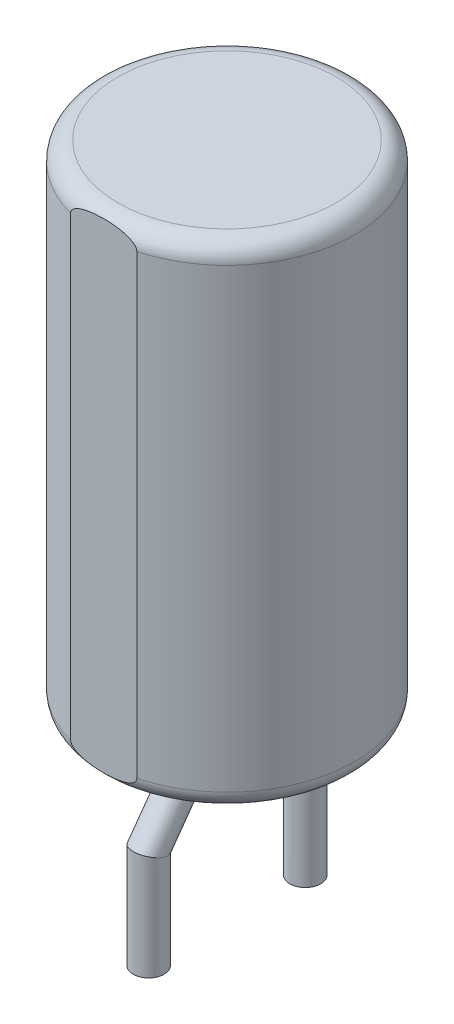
from build123d import *

# Parameters (mm, degrees)
ESQUISSE1_R             = 2.07
EXTRUSION1_DEPTH        = 8
CONG_1_R                = 0.3
ESQUISSE2_W             = 1.114215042
ESQUISSE2_H             = 0.155781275
ENL_V_MAT_EXTRU_1_DEPTH = 9.518791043
ESQUISSE3_R             = 0.250051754


with BuildPart() as part:
    # Esquisse1 → Extrusion1 (new body)
    with BuildSketch(Plane(origin=(0, 0, 0), x_dir=(1, 0, 0), z_dir=(0, 1, 0))):
        with Locations(Location((0, 0, 0), (0, 0, 270))):
            Circle(ESQUISSE1_R)
    extrude(amount=EXTRUSION1_DEPTH)

    # Cong_1
    cong_1_edges = [part.edges().sort_by_distance(p)[0] for p in [
        (0, 0, -2.07),
        (0, 8, -2.07),
    ]]
    fillet(cong_1_edges, radius=CONG_1_R)

    # Esquisse2 → Enl_v. mat.-Extru.1 (cut, through all)
    with BuildSketch(Plane(origin=(0, 8, 0), x_dir=(-1, 0, 0), z_dir=(0, 1, 0))):
        with Locations((0.020159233, 2.07703709)):
            Rectangle(ESQUISSE2_W, ESQUISSE2_H)
    extrude(amount=-ENL_V_MAT_EXTRU_1_DEPTH, mode=Mode.SUBTRACT)

    # Balayage1: sweep along a path in Esquisse4
    with BuildLine(Plane(origin=(0, 0, 0), x_dir=(0, 0, -1), z_dir=(1, 0, 0))) as balayage1_path:
        Line((0.79403387, 0), (0.79403387, -0.655620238))
        Line((0.79403387, -0.655620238), (1.27, -1.317117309))
        Line((1.27, -1.317117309), (1.27, -2.96115967))
    # Esquisse3 → Balayage1 (sweep)
    with BuildSketch(Plane.XZ):
        with Locations((0, -0.79403387)):
            Circle(ESQUISSE3_R)
    balayage1 = sweep(path=balayage1_path.line, transition=Transition.RIGHT)

    # Sym_trie1: Balayage1 across plane
    add(balayage1.mirror(Plane.XY))


solid = part.part
